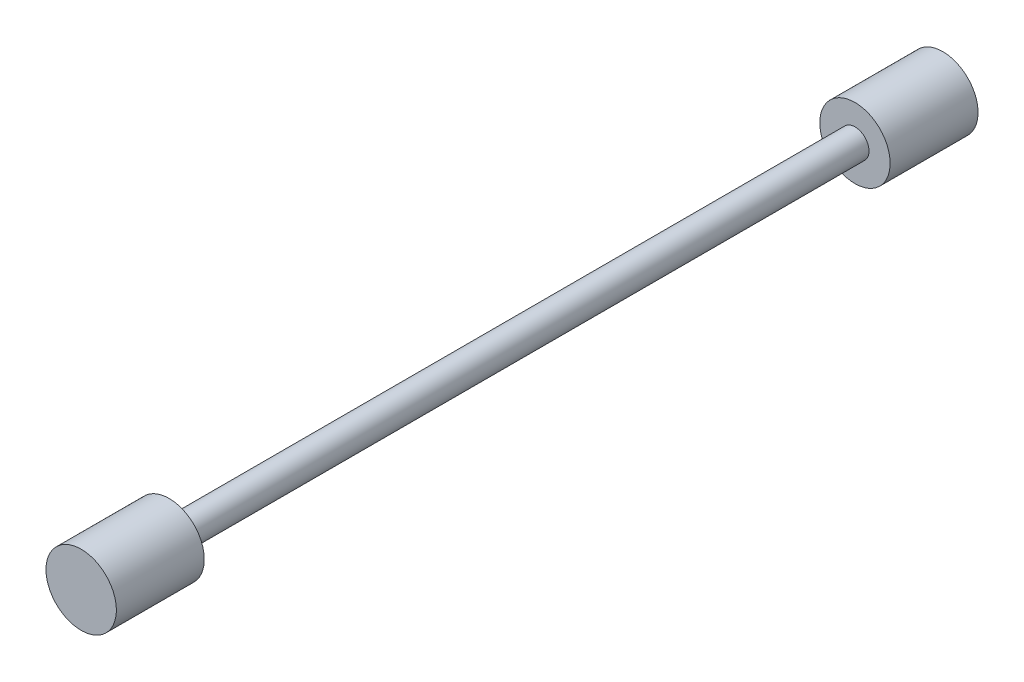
ISO-10303-21;
HEADER;
FILE_DESCRIPTION(('STEP AP214'),'2;1');
FILE_NAME('part.step','',(''),(''),'','','');
FILE_SCHEMA(('AUTOMOTIVE_DESIGN { 1 0 10303 214 1 1 1 1 }'));
ENDSEC;
DATA;
#1=APPLICATION_CONTEXT('core data for automotive mechanical design processes');
#2=APPLICATION_PROTOCOL_DEFINITION('international standard','automotive_design',2000,#1);
#3=PRODUCT_CONTEXT('',#1,'mechanical');
#4=PRODUCT('Part','Part','',(#3));
#5=PRODUCT_RELATED_PRODUCT_CATEGORY('part','',(#4));
#6=PRODUCT_DEFINITION_FORMATION('','',#4);
#7=PRODUCT_DEFINITION_CONTEXT('part definition',#1,'design');
#8=PRODUCT_DEFINITION('design','',#6,#7);
#9=PRODUCT_DEFINITION_SHAPE('','',#8);
#10=(LENGTH_UNIT() NAMED_UNIT(*) SI_UNIT(.MILLI.,.METRE.));
#11=(NAMED_UNIT(*) PLANE_ANGLE_UNIT() SI_UNIT($,.RADIAN.));
#12=(NAMED_UNIT(*) SI_UNIT($,.STERADIAN.) SOLID_ANGLE_UNIT());
#13=UNCERTAINTY_MEASURE_WITH_UNIT(LENGTH_MEASURE(1.E-05),#10,'distance_accuracy_value','');
#14=(GEOMETRIC_REPRESENTATION_CONTEXT(3) GLOBAL_UNCERTAINTY_ASSIGNED_CONTEXT((#13)) GLOBAL_UNIT_ASSIGNED_CONTEXT((#10,
#11,#12)) REPRESENTATION_CONTEXT('',''));
#15=CARTESIAN_POINT('',(0.,0.,0.));
#16=DIRECTION('',(0.,0.,1.));
#17=DIRECTION('',(1.,0.,0.));
#18=AXIS2_PLACEMENT_3D('',#15,#16,#17);
#19=CARTESIAN_POINT('',(0.,0.,490.));
#20=DIRECTION('',(0.,0.,-1.));
#21=DIRECTION('',(-1.,0.,0.));
#22=AXIS2_PLACEMENT_3D('',#19,#20,#21);
#23=CYLINDRICAL_SURFACE('',#22,8.);
#24=CARTESIAN_POINT('',(0.,0.,50.));
#25=DIRECTION('',(0.,0.,-1.));
#26=DIRECTION('',(-1.,0.,0.));
#27=AXIS2_PLACEMENT_3D('',#24,#25,#26);
#28=CIRCLE('',#27,8.);
#29=CARTESIAN_POINT('',(-8.,0.,50.));
#30=VERTEX_POINT('',#29);
#31=EDGE_CURVE('E44',#30,#30,#28,.T.);
#32=ORIENTED_EDGE('',*,*,#31,.F.);
#33=EDGE_LOOP('',(#32));
#34=FACE_BOUND('',#33,.T.);
#35=CARTESIAN_POINT('',(0.,0.,440.));
#36=DIRECTION('',(0.,0.,1.));
#37=DIRECTION('',(1.,0.,0.));
#38=AXIS2_PLACEMENT_3D('',#35,#36,#37);
#39=CIRCLE('',#38,8.);
#40=CARTESIAN_POINT('',(8.,0.,440.));
#41=VERTEX_POINT('',#40);
#42=EDGE_CURVE('E10',#41,#41,#39,.T.);
#43=ORIENTED_EDGE('',*,*,#42,.F.);
#44=EDGE_LOOP('',(#43));
#45=FACE_BOUND('',#44,.T.);
#46=ADVANCED_FACE('F36',(#34,#45),#23,.T.);
#47=CARTESIAN_POINT('',(0.,0.,50.));
#48=DIRECTION('',(0.,0.,-1.));
#49=DIRECTION('',(-1.,0.,0.));
#50=AXIS2_PLACEMENT_3D('',#47,#48,#49);
#51=PLANE('',#50);
#52=ORIENTED_EDGE('',*,*,#31,.T.);
#53=EDGE_LOOP('',(#52));
#54=FACE_BOUND('',#53,.T.);
#55=CARTESIAN_POINT('',(0.,0.,50.));
#56=DIRECTION('',(0.,0.,-1.));
#57=DIRECTION('',(-1.,0.,0.));
#58=AXIS2_PLACEMENT_3D('',#55,#56,#57);
#59=CIRCLE('',#58,20.);
#60=CARTESIAN_POINT('',(-20.,0.,50.));
#61=VERTEX_POINT('',#60);
#62=EDGE_CURVE('E58',#61,#61,#59,.T.);
#63=ORIENTED_EDGE('',*,*,#62,.F.);
#64=EDGE_LOOP('',(#63));
#65=FACE_BOUND('',#64,.T.);
#66=ADVANCED_FACE('F69',(#54,#65),#51,.F.);
#67=CARTESIAN_POINT('',(0.,0.,0.));
#68=DIRECTION('',(0.,0.,-1.));
#69=DIRECTION('',(-1.,0.,0.));
#70=AXIS2_PLACEMENT_3D('',#67,#68,#69);
#71=CYLINDRICAL_SURFACE('',#70,20.);
#72=CARTESIAN_POINT('',(0.,0.,0.));
#73=DIRECTION('',(0.,0.,-1.));
#74=DIRECTION('',(-1.,0.,0.));
#75=AXIS2_PLACEMENT_3D('',#72,#73,#74);
#76=CIRCLE('',#75,20.);
#77=CARTESIAN_POINT('',(-20.,0.,0.));
#78=VERTEX_POINT('',#77);
#79=EDGE_CURVE('E55',#78,#78,#76,.T.);
#80=ORIENTED_EDGE('',*,*,#79,.F.);
#81=EDGE_LOOP('',(#80));
#82=FACE_BOUND('',#81,.T.);
#83=ORIENTED_EDGE('',*,*,#62,.T.);
#84=EDGE_LOOP('',(#83));
#85=FACE_BOUND('',#84,.T.);
#86=ADVANCED_FACE('F79',(#82,#85),#71,.T.);
#87=CARTESIAN_POINT('',(0.,0.,0.));
#88=DIRECTION('',(0.,0.,1.));
#89=DIRECTION('',(1.,0.,0.));
#90=AXIS2_PLACEMENT_3D('',#87,#88,#89);
#91=PLANE('',#90);
#92=ORIENTED_EDGE('',*,*,#79,.T.);
#93=EDGE_LOOP('',(#92));
#94=FACE_BOUND('',#93,.T.);
#95=ADVANCED_FACE('F85',(#94),#91,.F.);
#96=CARTESIAN_POINT('',(0.,0.,440.));
#97=DIRECTION('',(0.,0.,1.));
#98=DIRECTION('',(1.,0.,0.));
#99=AXIS2_PLACEMENT_3D('',#96,#97,#98);
#100=PLANE('',#99);
#101=ORIENTED_EDGE('',*,*,#42,.T.);
#102=EDGE_LOOP('',(#101));
#103=FACE_BOUND('',#102,.T.);
#104=CARTESIAN_POINT('',(0.,0.,440.));
#105=DIRECTION('',(0.,0.,-1.));
#106=DIRECTION('',(-1.,0.,0.));
#107=AXIS2_PLACEMENT_3D('',#104,#105,#106);
#108=CIRCLE('',#107,19.9999999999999);
#109=CARTESIAN_POINT('',(-19.9999999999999,0.,440.));
#110=VERTEX_POINT('',#109);
#111=EDGE_CURVE('E53',#110,#110,#108,.T.);
#112=ORIENTED_EDGE('',*,*,#111,.T.);
#113=EDGE_LOOP('',(#112));
#114=FACE_BOUND('',#113,.T.);
#115=ADVANCED_FACE('F115',(#103,#114),#100,.F.);
#116=CARTESIAN_POINT('',(0.,0.,0.));
#117=DIRECTION('',(0.,0.,-1.));
#118=DIRECTION('',(-1.,0.,0.));
#119=AXIS2_PLACEMENT_3D('',#116,#117,#118);
#120=CYLINDRICAL_SURFACE('',#119,19.9999999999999);
#121=ORIENTED_EDGE('',*,*,#111,.F.);
#122=EDGE_LOOP('',(#121));
#123=FACE_BOUND('',#122,.T.);
#124=CARTESIAN_POINT('',(0.,0.,490.));
#125=DIRECTION('',(0.,0.,-1.));
#126=DIRECTION('',(-1.,0.,0.));
#127=AXIS2_PLACEMENT_3D('',#124,#125,#126);
#128=CIRCLE('',#127,19.9999999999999);
#129=CARTESIAN_POINT('',(-19.9999999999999,0.,490.));
#130=VERTEX_POINT('',#129);
#131=EDGE_CURVE('E168',#130,#130,#128,.T.);
#132=ORIENTED_EDGE('',*,*,#131,.T.);
#133=EDGE_LOOP('',(#132));
#134=FACE_BOUND('',#133,.T.);
#135=ADVANCED_FACE('F125',(#123,#134),#120,.T.);
#136=CARTESIAN_POINT('',(0.,0.,490.));
#137=DIRECTION('',(0.,0.,1.));
#138=DIRECTION('',(1.,0.,0.));
#139=AXIS2_PLACEMENT_3D('',#136,#137,#138);
#140=PLANE('',#139);
#141=ORIENTED_EDGE('',*,*,#131,.F.);
#142=EDGE_LOOP('',(#141));
#143=FACE_BOUND('',#142,.T.);
#144=ADVANCED_FACE('F134',(#143),#140,.T.);
#145=CLOSED_SHELL('',(#46,#66,#86,#95,#115,#135,#144));
#146=CARTESIAN_POINT('',(0.,0.,50.));
#147=DIRECTION('',(0.,0.,-1.));
#148=DIRECTION('',(-1.,0.,0.));
#149=AXIS2_PLACEMENT_3D('',#146,#147,#148);
#150=CIRCLE('',#149,6.);
#151=CARTESIAN_POINT('',(-6.,0.,50.));
#152=VERTEX_POINT('',#151);
#153=EDGE_CURVE('E49',#152,#152,#150,.T.);
#154=ORIENTED_EDGE('',*,*,#153,.F.);
#155=EDGE_LOOP('',(#154));
#156=FACE_BOUND('',#155,.T.);
#157=ADVANCED_FACE('F66',(#156),#51,.F.);
#158=CARTESIAN_POINT('',(0.,0.,490.));
#159=DIRECTION('',(0.,0.,-1.));
#160=DIRECTION('',(-1.,0.,0.));
#161=AXIS2_PLACEMENT_3D('',#158,#159,#160);
#162=CYLINDRICAL_SURFACE('',#161,6.);
#163=ORIENTED_EDGE('',*,*,#153,.T.);
#164=EDGE_LOOP('',(#163));
#165=FACE_BOUND('',#164,.T.);
#166=CARTESIAN_POINT('',(0.,0.,440.));
#167=DIRECTION('',(0.,0.,1.));
#168=DIRECTION('',(1.,0.,0.));
#169=AXIS2_PLACEMENT_3D('',#166,#167,#168);
#170=CIRCLE('',#169,6.);
#171=CARTESIAN_POINT('',(6.,0.,440.));
#172=VERTEX_POINT('',#171);
#173=EDGE_CURVE('E39',#172,#172,#170,.T.);
#174=ORIENTED_EDGE('',*,*,#173,.T.);
#175=EDGE_LOOP('',(#174));
#176=FACE_BOUND('',#175,.T.);
#177=ADVANCED_FACE('F63',(#165,#176),#162,.F.);
#178=ORIENTED_EDGE('',*,*,#173,.F.);
#179=EDGE_LOOP('',(#178));
#180=FACE_BOUND('',#179,.T.);
#181=ADVANCED_FACE('F75',(#180),#100,.F.);
#182=CLOSED_SHELL('',(#157,#177,#181));
#183=ORIENTED_CLOSED_SHELL('',*,#182,.T.);
#184=BREP_WITH_VOIDS('B2',#145,(#183));
#185=ADVANCED_BREP_SHAPE_REPRESENTATION('',(#18,#184),#14);
#186=SHAPE_DEFINITION_REPRESENTATION(#9,#185);
ENDSEC;
END-ISO-10303-21;
